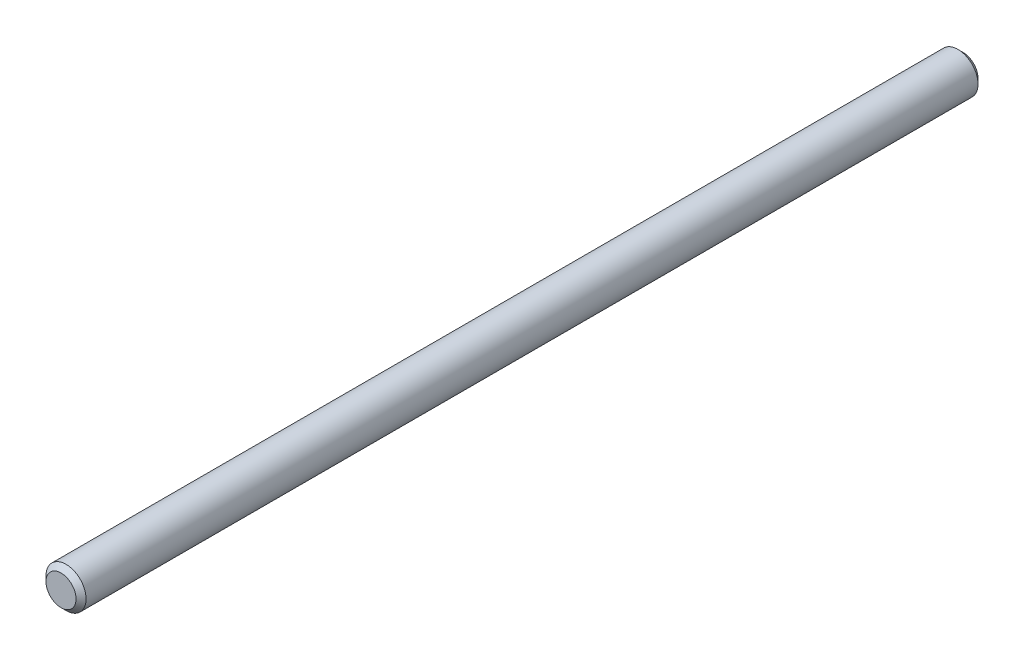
ISO-10303-21;
HEADER;
FILE_DESCRIPTION(('STEP AP214'),'2;1');
FILE_NAME('part.step','',(''),(''),'','','');
FILE_SCHEMA(('AUTOMOTIVE_DESIGN { 1 0 10303 214 1 1 1 1 }'));
ENDSEC;
DATA;
#1=APPLICATION_CONTEXT('core data for automotive mechanical design processes');
#2=APPLICATION_PROTOCOL_DEFINITION('international standard','automotive_design',2000,#1);
#3=PRODUCT_CONTEXT('',#1,'mechanical');
#4=PRODUCT('Part','Part','',(#3));
#5=PRODUCT_RELATED_PRODUCT_CATEGORY('part','',(#4));
#6=PRODUCT_DEFINITION_FORMATION('','',#4);
#7=PRODUCT_DEFINITION_CONTEXT('part definition',#1,'design');
#8=PRODUCT_DEFINITION('design','',#6,#7);
#9=PRODUCT_DEFINITION_SHAPE('','',#8);
#10=(LENGTH_UNIT() NAMED_UNIT(*) SI_UNIT(.MILLI.,.METRE.));
#11=(NAMED_UNIT(*) PLANE_ANGLE_UNIT() SI_UNIT($,.RADIAN.));
#12=(NAMED_UNIT(*) SI_UNIT($,.STERADIAN.) SOLID_ANGLE_UNIT());
#13=UNCERTAINTY_MEASURE_WITH_UNIT(LENGTH_MEASURE(1.E-05),#10,'distance_accuracy_value','');
#14=(GEOMETRIC_REPRESENTATION_CONTEXT(3) GLOBAL_UNCERTAINTY_ASSIGNED_CONTEXT((#13)) GLOBAL_UNIT_ASSIGNED_CONTEXT((#10,
#11,#12)) REPRESENTATION_CONTEXT('',''));
#15=CARTESIAN_POINT('',(0.,0.,0.));
#16=DIRECTION('',(0.,0.,1.));
#17=DIRECTION('',(1.,0.,0.));
#18=AXIS2_PLACEMENT_3D('',#15,#16,#17);
#19=CARTESIAN_POINT('',(0.,0.,-90.));
#20=DIRECTION('',(0.,0.,1.));
#21=DIRECTION('',(1.,0.,0.));
#22=AXIS2_PLACEMENT_3D('',#19,#20,#21);
#23=CYLINDRICAL_SURFACE('',#22,2.);
#24=CARTESIAN_POINT('',(0.,0.,-89.5));
#25=DIRECTION('',(0.,0.,1.));
#26=DIRECTION('',(1.,0.,0.));
#27=AXIS2_PLACEMENT_3D('',#24,#25,#26);
#28=CIRCLE('',#27,2.);
#29=CARTESIAN_POINT('',(2.,0.,-89.5));
#30=VERTEX_POINT('',#29);
#31=EDGE_CURVE('E43',#30,#30,#28,.T.);
#32=CARTESIAN_POINT('',(0.,0.,-0.499999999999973));
#33=DIRECTION('',(0.,0.,1.));
#34=DIRECTION('',(1.,0.,0.));
#35=AXIS2_PLACEMENT_3D('',#32,#33,#34);
#36=CIRCLE('',#35,2.);
#37=CARTESIAN_POINT('',(2.,0.,-0.499999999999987));
#38=VERTEX_POINT('',#37);
#39=EDGE_CURVE('E47',#38,#38,#36,.F.);
#40=CARTESIAN_POINT('',(2.,0.,-89.5));
#41=CARTESIAN_POINT('',(2.,0.,-88.5729166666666));
#42=CARTESIAN_POINT('',(2.,0.,-87.6458333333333));
#43=CARTESIAN_POINT('',(2.,0.,-85.7916666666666));
#44=CARTESIAN_POINT('',(2.,0.,-84.8645833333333));
#45=CARTESIAN_POINT('',(2.,0.,-83.0104166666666));
#46=CARTESIAN_POINT('',(2.,0.,-82.0833333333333));
#47=CARTESIAN_POINT('',(2.,0.,-80.2291666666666));
#48=CARTESIAN_POINT('',(2.,0.,-79.3020833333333));
#49=CARTESIAN_POINT('',(2.,0.,-77.4479166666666));
#50=CARTESIAN_POINT('',(2.,0.,-76.5208333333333));
#51=CARTESIAN_POINT('',(2.,0.,-74.6666666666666));
#52=CARTESIAN_POINT('',(2.,0.,-73.7395833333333));
#53=CARTESIAN_POINT('',(2.,0.,-71.8854166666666));
#54=CARTESIAN_POINT('',(2.,0.,-70.9583333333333));
#55=CARTESIAN_POINT('',(2.,0.,-69.1041666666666));
#56=CARTESIAN_POINT('',(2.,0.,-68.1770833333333));
#57=CARTESIAN_POINT('',(2.,0.,-66.3229166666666));
#58=CARTESIAN_POINT('',(2.,0.,-65.3958333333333));
#59=CARTESIAN_POINT('',(2.,0.,-63.5416666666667));
#60=CARTESIAN_POINT('',(2.,0.,-62.6145833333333));
#61=CARTESIAN_POINT('',(2.,0.,-60.7604166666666));
#62=CARTESIAN_POINT('',(2.,0.,-59.8333333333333));
#63=CARTESIAN_POINT('',(2.,0.,-57.9791666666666));
#64=CARTESIAN_POINT('',(2.,0.,-57.0520833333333));
#65=CARTESIAN_POINT('',(2.,0.,-55.1979166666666));
#66=CARTESIAN_POINT('',(2.,0.,-54.2708333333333));
#67=CARTESIAN_POINT('',(2.,0.,-52.4166666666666));
#68=CARTESIAN_POINT('',(2.,0.,-51.4895833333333));
#69=CARTESIAN_POINT('',(2.,0.,-49.6354166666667));
#70=CARTESIAN_POINT('',(2.,0.,-48.7083333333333));
#71=CARTESIAN_POINT('',(2.,0.,-46.8541666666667));
#72=CARTESIAN_POINT('',(2.,0.,-45.9270833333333));
#73=CARTESIAN_POINT('',(2.,0.,-44.0729166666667));
#74=CARTESIAN_POINT('',(2.,0.,-43.1458333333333));
#75=CARTESIAN_POINT('',(2.,0.,-41.2916666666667));
#76=CARTESIAN_POINT('',(2.,0.,-40.3645833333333));
#77=CARTESIAN_POINT('',(2.,0.,-38.5104166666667));
#78=CARTESIAN_POINT('',(2.,0.,-37.5833333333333));
#79=CARTESIAN_POINT('',(2.,0.,-35.7291666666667));
#80=CARTESIAN_POINT('',(2.,0.,-34.8020833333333));
#81=CARTESIAN_POINT('',(2.,0.,-32.9479166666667));
#82=CARTESIAN_POINT('',(2.,0.,-32.0208333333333));
#83=CARTESIAN_POINT('',(2.,0.,-30.1666666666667));
#84=CARTESIAN_POINT('',(2.,0.,-29.2395833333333));
#85=CARTESIAN_POINT('',(2.,0.,-27.3854166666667));
#86=CARTESIAN_POINT('',(2.,0.,-26.4583333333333));
#87=CARTESIAN_POINT('',(2.,0.,-24.6041666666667));
#88=CARTESIAN_POINT('',(2.,0.,-23.6770833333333));
#89=CARTESIAN_POINT('',(2.,0.,-21.8229166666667));
#90=CARTESIAN_POINT('',(2.,0.,-20.8958333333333));
#91=CARTESIAN_POINT('',(2.,0.,-19.0416666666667));
#92=CARTESIAN_POINT('',(2.,0.,-18.1145833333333));
#93=CARTESIAN_POINT('',(2.,0.,-16.2604166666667));
#94=CARTESIAN_POINT('',(2.,0.,-15.3333333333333));
#95=CARTESIAN_POINT('',(2.,0.,-13.4791666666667));
#96=CARTESIAN_POINT('',(2.,0.,-12.5520833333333));
#97=CARTESIAN_POINT('',(2.,0.,-10.6979166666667));
#98=CARTESIAN_POINT('',(2.,0.,-9.77083333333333));
#99=CARTESIAN_POINT('',(2.,0.,-7.91666666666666));
#100=CARTESIAN_POINT('',(2.,0.,-6.98958333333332));
#101=CARTESIAN_POINT('',(2.,0.,-5.13541666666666));
#102=CARTESIAN_POINT('',(2.,0.,-4.20833333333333));
#103=CARTESIAN_POINT('',(2.,0.,-2.35416666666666));
#104=CARTESIAN_POINT('',(2.,0.,-1.42708333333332));
#105=CARTESIAN_POINT('',(2.,0.,-0.499999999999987));
#106=B_SPLINE_CURVE_WITH_KNOTS('',3,(#40,#41,#42,#43,#44,#45,#46,#47,#48,#49,#50,#51,#52,#53,
#54,#55,#56,#57,#58,#59,#60,#61,#62,#63,#64,#65,#66,#67,#68,#69,#70,#71,#72,#73,#74,#75,#76,#77,
#78,#79,#80,#81,#82,#83,#84,#85,#86,#87,#88,#89,#90,#91,#92,#93,#94,#95,#96,#97,#98,#99,#100,
#101,#102,#103,#104,#105),.UNSPECIFIED.,.F.,.F.,(4,2,2,2,2,2,2,2,2,2,2,2,2,2,2,2,2,2,2,2,2,2,2,
2,2,2,2,2,2,2,2,2,4),(0.,2.78125000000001,5.56250000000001,8.34375000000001,11.125,13.90625,
16.6875,19.46875,22.25,25.03125,27.8125,30.59375,33.375,36.15625,38.9375,41.71875,44.5,47.28125,
50.0625,52.84375,55.625,58.40625,61.1875,63.96875,66.75,69.53125,72.3125,75.09375,77.875,
80.65625,83.4375,86.21875,89.),.UNSPECIFIED.);
#107=EDGE_CURVE('BSEAM32',#30,#38,#106,.T.);
#108=ORIENTED_EDGE('',*,*,#31,.T.);
#109=ORIENTED_EDGE('',*,*,#39,.T.);
#110=ORIENTED_EDGE('',*,*,#107,.T.);
#111=ORIENTED_EDGE('',*,*,#107,.F.);
#112=EDGE_LOOP('',(#108,#110,#109,#111));
#113=FACE_BOUND('',#112,.T.);
#114=ADVANCED_FACE('F32',(#113),#23,.T.);
#115=CARTESIAN_POINT('',(0.,0.,-90.));
#116=DIRECTION('',(0.,0.,1.));
#117=DIRECTION('',(1.,0.,0.));
#118=AXIS2_PLACEMENT_3D('',#115,#116,#117);
#119=PLANE('',#118);
#120=CARTESIAN_POINT('',(0.,0.,-90.));
#121=DIRECTION('',(0.,0.,1.));
#122=DIRECTION('',(1.,0.,0.));
#123=AXIS2_PLACEMENT_3D('',#120,#121,#122);
#124=CIRCLE('',#123,1.49999999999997);
#125=CARTESIAN_POINT('',(1.49999999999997,0.,-90.));
#126=VERTEX_POINT('',#125);
#127=EDGE_CURVE('E39',#126,#126,#124,.F.);
#128=ORIENTED_EDGE('',*,*,#127,.T.);
#129=EDGE_LOOP('',(#128));
#130=FACE_BOUND('',#129,.T.);
#131=ADVANCED_FACE('F63',(#130),#119,.F.);
#132=CARTESIAN_POINT('',(0.,0.,0.));
#133=DIRECTION('',(0.,0.,1.));
#134=DIRECTION('',(1.,0.,0.));
#135=AXIS2_PLACEMENT_3D('',#132,#133,#134);
#136=PLANE('',#135);
#137=CARTESIAN_POINT('',(0.,0.,0.));
#138=DIRECTION('',(0.,0.,1.));
#139=DIRECTION('',(1.,0.,0.));
#140=AXIS2_PLACEMENT_3D('',#137,#138,#139);
#141=CIRCLE('',#140,1.5);
#142=CARTESIAN_POINT('',(1.5,0.,0.));
#143=VERTEX_POINT('',#142);
#144=EDGE_CURVE('E10',#143,#143,#141,.T.);
#145=ORIENTED_EDGE('',*,*,#144,.T.);
#146=EDGE_LOOP('',(#145));
#147=FACE_BOUND('',#146,.T.);
#148=ADVANCED_FACE('F60',(#147),#136,.T.);
#149=CARTESIAN_POINT('',(0.,0.,-89.5));
#150=DIRECTION('',(0.,0.,1.));
#151=DIRECTION('',(1.,0.,0.));
#152=AXIS2_PLACEMENT_3D('',#149,#150,#151);
#153=CONICAL_SURFACE('',#152,2.,0.785398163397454);
#154=ORIENTED_EDGE('',*,*,#127,.F.);
#155=EDGE_LOOP('',(#154));
#156=FACE_BOUND('',#155,.T.);
#157=ORIENTED_EDGE('',*,*,#31,.F.);
#158=EDGE_LOOP('',(#157));
#159=FACE_BOUND('',#158,.T.);
#160=ADVANCED_FACE('F56',(#156,#159),#153,.T.);
#161=CARTESIAN_POINT('',(0.,0.,0.));
#162=DIRECTION('',(0.,0.,-1.));
#163=DIRECTION('',(-1.,0.,0.));
#164=AXIS2_PLACEMENT_3D('',#161,#162,#163);
#165=CONICAL_SURFACE('',#164,1.5,0.785398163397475);
#166=ORIENTED_EDGE('',*,*,#39,.F.);
#167=EDGE_LOOP('',(#166));
#168=FACE_BOUND('',#167,.T.);
#169=ORIENTED_EDGE('',*,*,#144,.F.);
#170=EDGE_LOOP('',(#169));
#171=FACE_BOUND('',#170,.T.);
#172=ADVANCED_FACE('F34',(#168,#171),#165,.T.);
#173=CLOSED_SHELL('',(#114,#131,#148,#160,#172));
#174=MANIFOLD_SOLID_BREP('B2',#173);
#175=ADVANCED_BREP_SHAPE_REPRESENTATION('',(#18,#174),#14);
#176=SHAPE_DEFINITION_REPRESENTATION(#9,#175);
ENDSEC;
END-ISO-10303-21;
